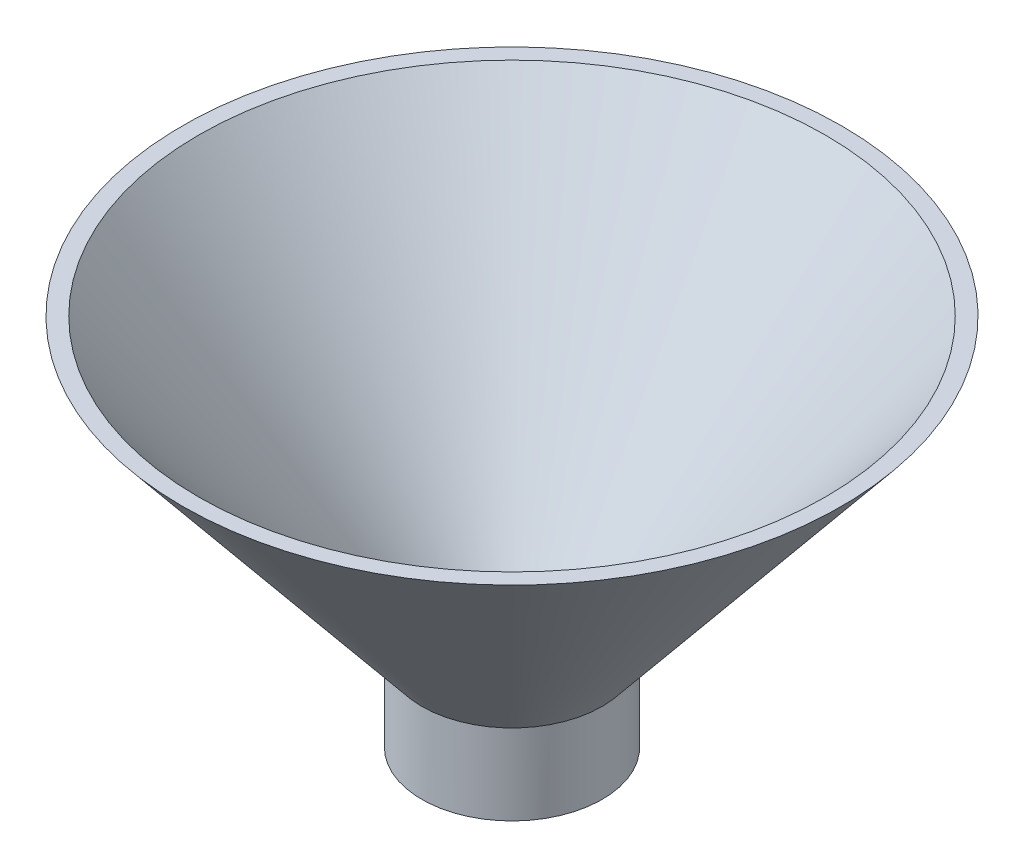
from build123d import *


with BuildPart() as part:
    # Sketch1 → Revolve1 (revolve)
    with BuildSketch(Plane.XY, mode=Mode.PRIVATE) as revolve1_sk:
        Polygon((6.35, 11.831253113), (6.35, 18.816253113), (27.178, 44.216253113), (28.575, 44.216253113), (7.825697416, 18.816253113), (7.825697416, 11.831253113), align=None)
    revolve(revolve1_sk.sketch.rotate(Axis((0, 18.251950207, 0), (0, 1, 0)), 90), axis=Axis((0, 18.251950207, 0), (0, 1, 0)))


solid = part.part
